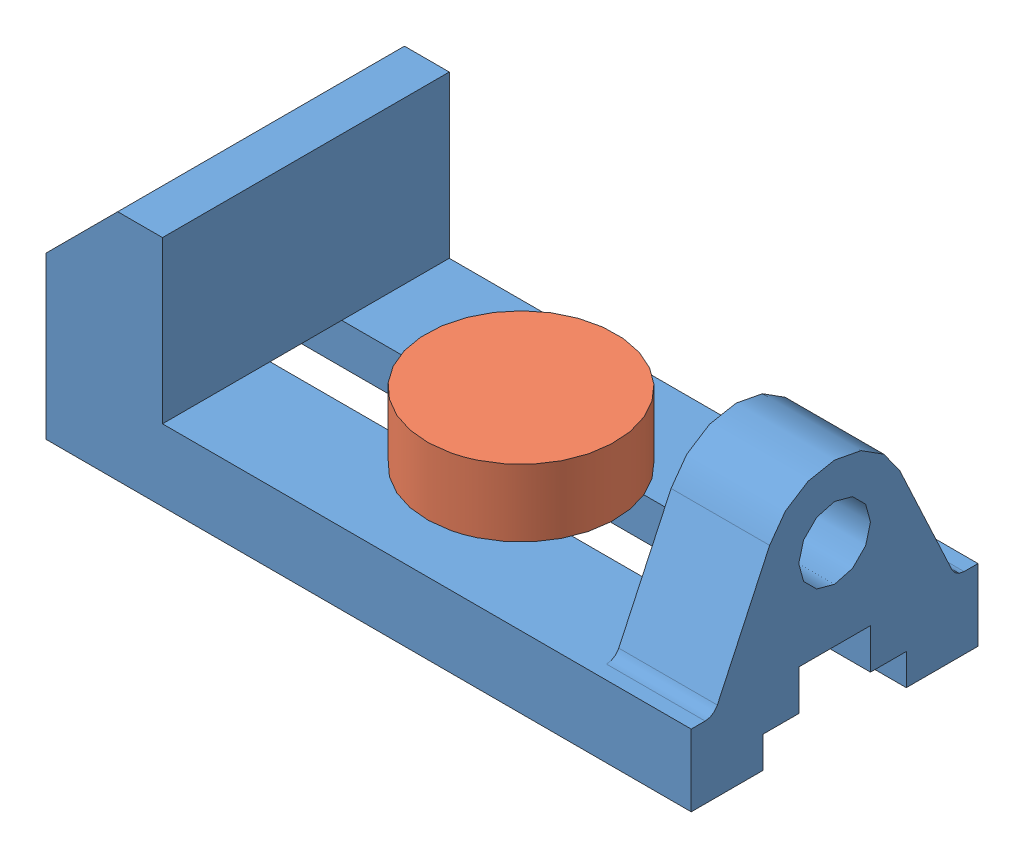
SolidWorks assembly width mate.SLDASM, configuration Default (file format 7000). Lengths in mm.
Overall size (144 52 64).
2 component instances, 2 part files, 3 mates.
Components (placement in the parent):
- vice-body-1: vice-body.SLDPRT [Default] at (24.2715 23.9331 8) size (144 52 64)
- Part1-1: Part1.SLDPRT [Default] at (123.2677 29.9331 78.4795) x (0.33426 0 0.942481) z (0 1 0) size (42 42 25)
Mates (geometry in assembly coordinates):
- Coincident5: coincident: plane of vice-body-1 through (168.2715 39.9331 40) normal (0 1 0); plane of Part1-1 through (112.3685 39.9331 8) normal (0 -1 0)
- Tangent1: tangent: plane of vice-body-1 through (24.2715 30.9331 16) normal (0 0 -1); cylinder of Part1-1 through (112.3685 39.9331 8) axis (0 -1 0) radius 8
- Width1: width anti-aligned: plane of vice-body-1 through (50.2715 39.9331 40) normal (1 0 0); plane of vice-body-1 through (146.2715 59.9331 8) normal (-1 0 0); cylinder of Part1-1 through (98.2715 54.9331 8) axis (0 -1 0) radius 21
